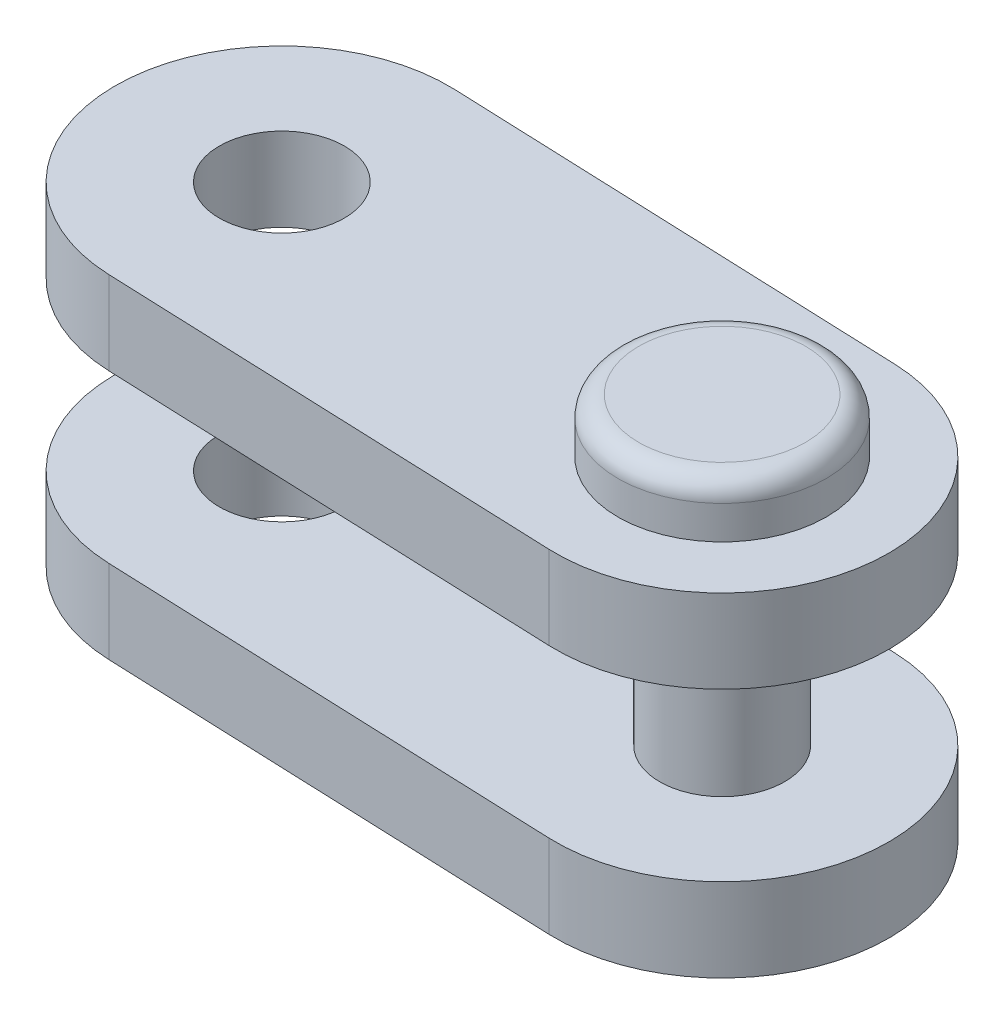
ISO-10303-21;
HEADER;
FILE_DESCRIPTION(('STEP AP214'),'2;1');
FILE_NAME('part.step','',(''),(''),'','','');
FILE_SCHEMA(('AUTOMOTIVE_DESIGN { 1 0 10303 214 1 1 1 1 }'));
ENDSEC;
DATA;
#1=APPLICATION_CONTEXT('core data for automotive mechanical design processes');
#2=APPLICATION_PROTOCOL_DEFINITION('international standard','automotive_design',2000,#1);
#3=PRODUCT_CONTEXT('',#1,'mechanical');
#4=PRODUCT('Part','Part','',(#3));
#5=PRODUCT_RELATED_PRODUCT_CATEGORY('part','',(#4));
#6=PRODUCT_DEFINITION_FORMATION('','',#4);
#7=PRODUCT_DEFINITION_CONTEXT('part definition',#1,'design');
#8=PRODUCT_DEFINITION('design','',#6,#7);
#9=PRODUCT_DEFINITION_SHAPE('','',#8);
#10=(LENGTH_UNIT() NAMED_UNIT(*) SI_UNIT(.MILLI.,.METRE.));
#11=(NAMED_UNIT(*) PLANE_ANGLE_UNIT() SI_UNIT($,.RADIAN.));
#12=(NAMED_UNIT(*) SI_UNIT($,.STERADIAN.) SOLID_ANGLE_UNIT());
#13=UNCERTAINTY_MEASURE_WITH_UNIT(LENGTH_MEASURE(1.E-05),#10,'distance_accuracy_value','');
#14=(GEOMETRIC_REPRESENTATION_CONTEXT(3) GLOBAL_UNCERTAINTY_ASSIGNED_CONTEXT((#13)) GLOBAL_UNIT_ASSIGNED_CONTEXT((#10,
#11,#12)) REPRESENTATION_CONTEXT('',''));
#15=CARTESIAN_POINT('',(0.,0.,0.));
#16=DIRECTION('',(0.,0.,1.));
#17=DIRECTION('',(1.,0.,0.));
#18=AXIS2_PLACEMENT_3D('',#15,#16,#17);
#19=CARTESIAN_POINT('',(-10.991642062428,4.,-0.428724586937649));
#20=DIRECTION('',(0.,-1.,0.));
#21=DIRECTION('',(0.999207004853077,0.,0.0398165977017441));
#22=AXIS2_PLACEMENT_3D('',#19,#20,#21);
#23=PLANE('',#22);
#24=DIRECTION('',(0.999240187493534,0.,0.038974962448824));
#25=VECTOR('',#24,1.);
#26=CARTESIAN_POINT('',(-11.1475419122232,4.00000000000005,3.56823616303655));
#27=LINE('',#26,#25);
#28=CARTESIAN_POINT('',(-11.1475419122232,4.,3.56823616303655));
#29=VERTEX_POINT('',#28);
#30=CARTESIAN_POINT('',(-0.155899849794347,4.00000000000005,3.9969607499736));
#31=VERTEX_POINT('',#30);
#32=EDGE_CURVE('E168',#29,#31,#27,.T.);
#33=ORIENTED_EDGE('',*,*,#32,.T.);
#34=CARTESIAN_POINT('',(9.99200722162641E-13,4.00000000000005,-6.00214322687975E-13));
#35=DIRECTION('',(0.,1.,0.));
#36=DIRECTION('',(-0.999207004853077,0.,-0.0398165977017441));
#37=AXIS2_PLACEMENT_3D('',#34,#35,#36);
#38=CIRCLE('',#37,4.00000000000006);
#39=CARTESIAN_POINT('',(0.155899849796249,4.00000000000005,-3.99696074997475));
#40=VERTEX_POINT('',#39);
#41=EDGE_CURVE('E171',#40,#31,#38,.F.);
#42=ORIENTED_EDGE('',*,*,#41,.F.);
#43=DIRECTION('',(-0.999240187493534,0.,-0.038974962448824));
#44=VECTOR('',#43,1.);
#45=CARTESIAN_POINT('',(-10.8357422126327,4.,-4.4256853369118));
#46=LINE('',#45,#44);
#47=CARTESIAN_POINT('',(-10.8357422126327,4.,-4.4256853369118));
#48=VERTEX_POINT('',#47);
#49=EDGE_CURVE('E175',#40,#48,#46,.T.);
#50=ORIENTED_EDGE('',*,*,#49,.T.);
#51=CARTESIAN_POINT('',(-10.991642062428,4.,-0.428724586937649));
#52=DIRECTION('',(0.,1.,0.));
#53=DIRECTION('',(-0.999207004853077,0.,-0.0398165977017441));
#54=AXIS2_PLACEMENT_3D('',#51,#52,#53);
#55=CIRCLE('',#54,4.);
#56=EDGE_CURVE('E152',#29,#48,#55,.F.);
#57=ORIENTED_EDGE('',*,*,#56,.F.);
#58=EDGE_LOOP('',(#33,#42,#50,#57));
#59=FACE_BOUND('',#58,.T.);
#60=CARTESIAN_POINT('',(-10.991642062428,4.,-0.428724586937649));
#61=DIRECTION('',(0.,-1.,0.));
#62=DIRECTION('',(0.999207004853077,0.,0.0398165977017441));
#63=AXIS2_PLACEMENT_3D('',#60,#61,#62);
#64=CIRCLE('',#63,1.500000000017);
#65=CARTESIAN_POINT('',(-9.4928315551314,4.,-0.368999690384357));
#66=VERTEX_POINT('',#65);
#67=EDGE_CURVE('E149',#66,#66,#64,.F.);
#68=ORIENTED_EDGE('',*,*,#67,.F.);
#69=EDGE_LOOP('',(#68));
#70=FACE_BOUND('',#69,.T.);
#71=CARTESIAN_POINT('',(0.,4.,0.));
#72=DIRECTION('',(0.,-1.,0.));
#73=DIRECTION('',(1.,0.,0.));
#74=AXIS2_PLACEMENT_3D('',#71,#72,#73);
#75=CIRCLE('',#74,2.5);
#76=CARTESIAN_POINT('',(2.5,4.,0.));
#77=VERTEX_POINT('',#76);
#78=EDGE_CURVE('E26',#77,#77,#75,.T.);
#79=ORIENTED_EDGE('',*,*,#78,.T.);
#80=EDGE_LOOP('',(#79));
#81=FACE_BOUND('',#80,.T.);
#82=ADVANCED_FACE('F17',(#59,#70,#81),#23,.F.);
#83=CARTESIAN_POINT('',(0.,-4.00000000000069,0.));
#84=DIRECTION('',(0.,1.,0.));
#85=DIRECTION('',(-0.34082035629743,0.,0.940128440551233));
#86=AXIS2_PLACEMENT_3D('',#83,#84,#85);
#87=CYLINDRICAL_SURFACE('',#86,1.5);
#88=CARTESIAN_POINT('',(9.5062846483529E-13,-1.99999999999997,-6.00214322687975E-13));
#89=DIRECTION('',(0.,-1.,0.));
#90=DIRECTION('',(0.999207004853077,0.,0.0398165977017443));
#91=AXIS2_PLACEMENT_3D('',#88,#89,#90);
#92=CIRCLE('',#91,1.50000000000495);
#93=CARTESIAN_POINT('',(1.49881050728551,-1.99999999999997,0.0597248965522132));
#94=VERTEX_POINT('',#93);
#95=EDGE_CURVE('E133',#94,#94,#92,.F.);
#96=ORIENTED_EDGE('',*,*,#95,.T.);
#97=EDGE_LOOP('',(#96));
#98=FACE_BOUND('',#97,.T.);
#99=CARTESIAN_POINT('',(9.99200722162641E-13,2.00000000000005,-6.00214322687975E-13));
#100=DIRECTION('',(0.,-1.,0.));
#101=DIRECTION('',(0.999207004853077,0.,0.0398165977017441));
#102=AXIS2_PLACEMENT_3D('',#99,#100,#101);
#103=CIRCLE('',#102,1.50000000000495);
#104=CARTESIAN_POINT('',(1.49881050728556,2.00000000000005,0.0597248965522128));
#105=VERTEX_POINT('',#104);
#106=EDGE_CURVE('E129',#105,#105,#103,.T.);
#107=ORIENTED_EDGE('',*,*,#106,.T.);
#108=EDGE_LOOP('',(#107));
#109=FACE_BOUND('',#108,.T.);
#110=ADVANCED_FACE('F221',(#98,#109),#87,.T.);
#111=CARTESIAN_POINT('',(-10.991642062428,2.00000000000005,-0.428724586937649));
#112=DIRECTION('',(0.,-1.,0.));
#113=DIRECTION('',(0.999207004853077,0.,0.0398165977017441));
#114=AXIS2_PLACEMENT_3D('',#111,#112,#113);
#115=CYLINDRICAL_SURFACE('',#114,1.49999999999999);
#116=CARTESIAN_POINT('',(-10.991642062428,2.00000000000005,-0.428724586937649));
#117=DIRECTION('',(0.,-1.,0.));
#118=DIRECTION('',(0.999207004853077,0.,0.0398165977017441));
#119=AXIS2_PLACEMENT_3D('',#116,#117,#118);
#120=CIRCLE('',#119,1.500000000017);
#121=CARTESIAN_POINT('',(-9.4928315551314,2.00000000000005,-0.368999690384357));
#122=VERTEX_POINT('',#121);
#123=EDGE_CURVE('E146',#122,#122,#120,.T.);
#124=ORIENTED_EDGE('',*,*,#123,.T.);
#125=EDGE_LOOP('',(#124));
#126=FACE_BOUND('',#125,.T.);
#127=ORIENTED_EDGE('',*,*,#67,.T.);
#128=EDGE_LOOP('',(#127));
#129=FACE_BOUND('',#128,.T.);
#130=ADVANCED_FACE('F219',(#126,#129),#115,.F.);
#131=CARTESIAN_POINT('',(-10.8357422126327,2.00000000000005,-4.4256853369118));
#132=DIRECTION('',(-0.038974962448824,0.,0.999240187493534));
#133=DIRECTION('',(-0.999240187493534,0.,-0.038974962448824));
#134=AXIS2_PLACEMENT_3D('',#131,#132,#133);
#135=PLANE('',#134);
#136=DIRECTION('',(0.,1.,0.));
#137=VECTOR('',#136,1.);
#138=CARTESIAN_POINT('',(0.155899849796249,2.00000000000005,-3.9969607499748));
#139=LINE('',#138,#137);
#140=CARTESIAN_POINT('',(0.155899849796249,2.00000000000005,-3.99696074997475));
#141=VERTEX_POINT('',#140);
#142=EDGE_CURVE('E165',#141,#40,#139,.T.);
#143=ORIENTED_EDGE('',*,*,#142,.F.);
#144=DIRECTION('',(0.999240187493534,0.,0.038974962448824));
#145=VECTOR('',#144,1.);
#146=CARTESIAN_POINT('',(-10.8357422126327,2.00000000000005,-4.4256853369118));
#147=LINE('',#146,#145);
#148=CARTESIAN_POINT('',(-10.8357422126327,2.00000000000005,-4.4256853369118));
#149=VERTEX_POINT('',#148);
#150=EDGE_CURVE('E158',#149,#141,#147,.T.);
#151=ORIENTED_EDGE('',*,*,#150,.F.);
#152=DIRECTION('',(0.,-1.,0.));
#153=VECTOR('',#152,1.);
#154=CARTESIAN_POINT('',(-10.8357422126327,2.00000000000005,-4.4256853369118));
#155=LINE('',#154,#153);
#156=EDGE_CURVE('E172',#48,#149,#155,.T.);
#157=ORIENTED_EDGE('',*,*,#156,.F.);
#158=ORIENTED_EDGE('',*,*,#49,.F.);
#159=EDGE_LOOP('',(#143,#151,#157,#158));
#160=FACE_BOUND('',#159,.T.);
#161=ADVANCED_FACE('F236',(#160),#135,.F.);
#162=CARTESIAN_POINT('',(-10.991642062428,2.00000000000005,-0.428724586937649));
#163=DIRECTION('',(0.,1.,0.));
#164=DIRECTION('',(-0.999207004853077,0.,-0.0398165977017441));
#165=AXIS2_PLACEMENT_3D('',#162,#163,#164);
#166=CYLINDRICAL_SURFACE('',#165,4.);
#167=ORIENTED_EDGE('',*,*,#56,.T.);
#168=ORIENTED_EDGE('',*,*,#156,.T.);
#169=CARTESIAN_POINT('',(-10.991642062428,2.00000000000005,-0.428724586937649));
#170=DIRECTION('',(0.,1.,0.));
#171=DIRECTION('',(-0.999207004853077,0.,-0.0398165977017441));
#172=AXIS2_PLACEMENT_3D('',#169,#170,#171);
#173=CIRCLE('',#172,4.);
#174=CARTESIAN_POINT('',(-11.1475419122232,2.00000000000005,3.56823616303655));
#175=VERTEX_POINT('',#174);
#176=EDGE_CURVE('E161',#175,#149,#173,.F.);
#177=ORIENTED_EDGE('',*,*,#176,.F.);
#178=DIRECTION('',(0.,-1.,0.));
#179=VECTOR('',#178,1.);
#180=CARTESIAN_POINT('',(-11.1475419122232,2.00000000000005,3.56823616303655));
#181=LINE('',#180,#179);
#182=EDGE_CURVE('E164',#175,#29,#181,.F.);
#183=ORIENTED_EDGE('',*,*,#182,.T.);
#184=EDGE_LOOP('',(#167,#168,#177,#183));
#185=FACE_BOUND('',#184,.T.);
#186=ADVANCED_FACE('F233',(#185),#166,.T.);
#187=CARTESIAN_POINT('',(-11.1475419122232,2.00000000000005,3.56823616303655));
#188=DIRECTION('',(0.038974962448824,0.,-0.999240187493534));
#189=DIRECTION('',(0.999240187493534,0.,0.038974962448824));
#190=AXIS2_PLACEMENT_3D('',#187,#188,#189);
#191=PLANE('',#190);
#192=ORIENTED_EDGE('',*,*,#182,.F.);
#193=DIRECTION('',(-0.999240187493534,0.,-0.0389749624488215));
#194=VECTOR('',#193,1.);
#195=CARTESIAN_POINT('',(-0.155899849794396,2.00000000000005,3.99696074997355));
#196=LINE('',#195,#194);
#197=CARTESIAN_POINT('',(-0.155899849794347,2.00000000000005,3.9969607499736));
#198=VERTEX_POINT('',#197);
#199=EDGE_CURVE('E153',#198,#175,#196,.T.);
#200=ORIENTED_EDGE('',*,*,#199,.F.);
#201=DIRECTION('',(0.,-1.,0.));
#202=VECTOR('',#201,1.);
#203=CARTESIAN_POINT('',(-0.155899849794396,2.00000000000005,3.9969607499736));
#204=LINE('',#203,#202);
#205=EDGE_CURVE('E162',#31,#198,#204,.T.);
#206=ORIENTED_EDGE('',*,*,#205,.F.);
#207=ORIENTED_EDGE('',*,*,#32,.F.);
#208=EDGE_LOOP('',(#192,#200,#206,#207));
#209=FACE_BOUND('',#208,.T.);
#210=ADVANCED_FACE('F246',(#209),#191,.F.);
#211=CARTESIAN_POINT('',(9.99200722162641E-13,2.00000000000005,-6.00214322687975E-13));
#212=DIRECTION('',(0.,1.,0.));
#213=DIRECTION('',(-0.999207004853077,0.,-0.0398165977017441));
#214=AXIS2_PLACEMENT_3D('',#211,#212,#213);
#215=CYLINDRICAL_SURFACE('',#214,4.00000000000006);
#216=CARTESIAN_POINT('',(9.99200722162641E-13,2.00000000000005,-6.00214322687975E-13));
#217=DIRECTION('',(0.,1.,0.));
#218=DIRECTION('',(-0.999207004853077,0.,-0.0398165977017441));
#219=AXIS2_PLACEMENT_3D('',#216,#217,#218);
#220=CIRCLE('',#219,4.00000000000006);
#221=EDGE_CURVE('E157',#141,#198,#220,.F.);
#222=ORIENTED_EDGE('',*,*,#221,.F.);
#223=ORIENTED_EDGE('',*,*,#142,.T.);
#224=ORIENTED_EDGE('',*,*,#41,.T.);
#225=ORIENTED_EDGE('',*,*,#205,.T.);
#226=EDGE_LOOP('',(#222,#223,#224,#225));
#227=FACE_BOUND('',#226,.T.);
#228=ADVANCED_FACE('F243',(#227),#215,.T.);
#229=CARTESIAN_POINT('',(-10.991642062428,2.00000000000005,-0.428724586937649));
#230=DIRECTION('',(0.,-1.,0.));
#231=DIRECTION('',(0.999207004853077,0.,0.0398165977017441));
#232=AXIS2_PLACEMENT_3D('',#229,#230,#231);
#233=PLANE('',#232);
#234=ORIENTED_EDGE('',*,*,#221,.T.);
#235=ORIENTED_EDGE('',*,*,#199,.T.);
#236=ORIENTED_EDGE('',*,*,#176,.T.);
#237=ORIENTED_EDGE('',*,*,#150,.T.);
#238=EDGE_LOOP('',(#234,#235,#236,#237));
#239=FACE_BOUND('',#238,.T.);
#240=ORIENTED_EDGE('',*,*,#123,.F.);
#241=EDGE_LOOP('',(#240));
#242=FACE_BOUND('',#241,.T.);
#243=ORIENTED_EDGE('',*,*,#106,.F.);
#244=EDGE_LOOP('',(#243));
#245=FACE_BOUND('',#244,.T.);
#246=ADVANCED_FACE('F254',(#239,#242,#245),#233,.T.);
#247=CARTESIAN_POINT('',(-10.991642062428,-4.,-0.428724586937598));
#248=DIRECTION('',(0.,-1.,0.));
#249=DIRECTION('',(0.999207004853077,0.,0.0398165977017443));
#250=AXIS2_PLACEMENT_3D('',#247,#248,#249);
#251=CYLINDRICAL_SURFACE('',#250,1.49999999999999);
#252=CARTESIAN_POINT('',(-10.991642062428,-4.,-0.428724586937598));
#253=DIRECTION('',(0.,-1.,0.));
#254=DIRECTION('',(0.999207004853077,0.,0.0398165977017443));
#255=AXIS2_PLACEMENT_3D('',#252,#253,#254);
#256=CIRCLE('',#255,1.500000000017);
#257=CARTESIAN_POINT('',(-9.4928315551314,-4.,-0.368999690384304));
#258=VERTEX_POINT('',#257);
#259=EDGE_CURVE('E185',#258,#258,#256,.T.);
#260=ORIENTED_EDGE('',*,*,#259,.T.);
#261=EDGE_LOOP('',(#260));
#262=FACE_BOUND('',#261,.T.);
#263=CARTESIAN_POINT('',(-10.991642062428,-2.,-0.428724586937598));
#264=DIRECTION('',(0.,-1.,0.));
#265=DIRECTION('',(0.999207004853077,0.,0.0398165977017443));
#266=AXIS2_PLACEMENT_3D('',#263,#264,#265);
#267=CIRCLE('',#266,1.500000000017);
#268=CARTESIAN_POINT('',(-9.4928315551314,-2.,-0.368999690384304));
#269=VERTEX_POINT('',#268);
#270=EDGE_CURVE('E102',#269,#269,#267,.F.);
#271=ORIENTED_EDGE('',*,*,#270,.T.);
#272=EDGE_LOOP('',(#271));
#273=FACE_BOUND('',#272,.T.);
#274=ADVANCED_FACE('F213',(#262,#273),#251,.F.);
#275=CARTESIAN_POINT('',(-10.991642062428,-4.,-0.428724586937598));
#276=DIRECTION('',(0.,1.,0.));
#277=DIRECTION('',(-0.999207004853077,0.,-0.0398165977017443));
#278=AXIS2_PLACEMENT_3D('',#275,#276,#277);
#279=CYLINDRICAL_SURFACE('',#278,4.);
#280=CARTESIAN_POINT('',(-10.991642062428,-2.,-0.428724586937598));
#281=DIRECTION('',(0.,1.,0.));
#282=DIRECTION('',(-0.999207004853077,0.,-0.0398165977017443));
#283=AXIS2_PLACEMENT_3D('',#280,#281,#282);
#284=CIRCLE('',#283,4.);
#285=CARTESIAN_POINT('',(-11.1475419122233,-2.,3.56823616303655));
#286=VERTEX_POINT('',#285);
#287=CARTESIAN_POINT('',(-10.8357422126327,-2.,-4.4256853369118));
#288=VERTEX_POINT('',#287);
#289=EDGE_CURVE('E91',#286,#288,#284,.F.);
#290=ORIENTED_EDGE('',*,*,#289,.T.);
#291=DIRECTION('',(0.,-1.,0.));
#292=VECTOR('',#291,1.);
#293=CARTESIAN_POINT('',(-10.8357422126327,-4.,-4.4256853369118));
#294=LINE('',#293,#292);
#295=CARTESIAN_POINT('',(-10.8357422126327,-4.,-4.4256853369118));
#296=VERTEX_POINT('',#295);
#297=EDGE_CURVE('E95',#288,#296,#294,.T.);
#298=ORIENTED_EDGE('',*,*,#297,.T.);
#299=CARTESIAN_POINT('',(-10.991642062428,-4.,-0.428724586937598));
#300=DIRECTION('',(0.,1.,0.));
#301=DIRECTION('',(-0.999207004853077,0.,-0.0398165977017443));
#302=AXIS2_PLACEMENT_3D('',#299,#300,#301);
#303=CIRCLE('',#302,4.);
#304=CARTESIAN_POINT('',(-11.1475419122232,-4.,3.56823616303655));
#305=VERTEX_POINT('',#304);
#306=EDGE_CURVE('E121',#305,#296,#303,.F.);
#307=ORIENTED_EDGE('',*,*,#306,.F.);
#308=DIRECTION('',(0.,-1.,0.));
#309=VECTOR('',#308,1.);
#310=CARTESIAN_POINT('',(-11.1475419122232,-4.,3.56823616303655));
#311=LINE('',#310,#309);
#312=EDGE_CURVE('E98',#305,#286,#311,.F.);
#313=ORIENTED_EDGE('',*,*,#312,.T.);
#314=EDGE_LOOP('',(#290,#298,#307,#313));
#315=FACE_BOUND('',#314,.T.);
#316=ADVANCED_FACE('F93',(#315),#279,.T.);
#317=CARTESIAN_POINT('',(-10.8357422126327,-4.,-4.4256853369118));
#318=DIRECTION('',(-0.0389749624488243,0.,0.999240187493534));
#319=DIRECTION('',(-0.999240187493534,0.,-0.0389749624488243));
#320=AXIS2_PLACEMENT_3D('',#317,#318,#319);
#321=PLANE('',#320);
#322=DIRECTION('',(0.,1.,0.));
#323=VECTOR('',#322,1.);
#324=CARTESIAN_POINT('',(0.155899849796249,-4.,-3.9969607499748));
#325=LINE('',#324,#323);
#326=CARTESIAN_POINT('',(0.155899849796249,-4.,-3.99696074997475));
#327=VERTEX_POINT('',#326);
#328=CARTESIAN_POINT('',(0.155899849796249,-2.,-3.99696074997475));
#329=VERTEX_POINT('',#328);
#330=EDGE_CURVE('E118',#327,#329,#325,.T.);
#331=ORIENTED_EDGE('',*,*,#330,.F.);
#332=DIRECTION('',(0.999240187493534,0.,0.0389749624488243));
#333=VECTOR('',#332,1.);
#334=CARTESIAN_POINT('',(-10.8357422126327,-4.,-4.4256853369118));
#335=LINE('',#334,#333);
#336=EDGE_CURVE('E114',#296,#327,#335,.T.);
#337=ORIENTED_EDGE('',*,*,#336,.F.);
#338=ORIENTED_EDGE('',*,*,#297,.F.);
#339=DIRECTION('',(-0.999240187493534,0.,-0.0389749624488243));
#340=VECTOR('',#339,1.);
#341=CARTESIAN_POINT('',(-10.8357422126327,-2.,-4.4256853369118));
#342=LINE('',#341,#340);
#343=EDGE_CURVE('E105',#329,#288,#342,.T.);
#344=ORIENTED_EDGE('',*,*,#343,.F.);
#345=EDGE_LOOP('',(#331,#337,#338,#344));
#346=FACE_BOUND('',#345,.T.);
#347=ADVANCED_FACE('F112',(#346),#321,.F.);
#348=CARTESIAN_POINT('',(9.5062846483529E-13,-4.,-6.00214322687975E-13));
#349=DIRECTION('',(0.,1.,0.));
#350=DIRECTION('',(-0.999207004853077,0.,-0.0398165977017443));
#351=AXIS2_PLACEMENT_3D('',#348,#349,#350);
#352=CYLINDRICAL_SURFACE('',#351,4.00000000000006);
#353=CARTESIAN_POINT('',(9.5062846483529E-13,-4.,-6.00214322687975E-13));
#354=DIRECTION('',(0.,1.,0.));
#355=DIRECTION('',(-0.999207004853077,0.,-0.0398165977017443));
#356=AXIS2_PLACEMENT_3D('',#353,#354,#355);
#357=CIRCLE('',#356,4.00000000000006);
#358=CARTESIAN_POINT('',(-0.155899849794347,-4.,3.9969607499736));
#359=VERTEX_POINT('',#358);
#360=EDGE_CURVE('E123',#327,#359,#357,.F.);
#361=ORIENTED_EDGE('',*,*,#360,.F.);
#362=ORIENTED_EDGE('',*,*,#330,.T.);
#363=CARTESIAN_POINT('',(9.5062846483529E-13,-1.99999999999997,-6.00214322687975E-13));
#364=DIRECTION('',(0.,1.,0.));
#365=DIRECTION('',(-0.999207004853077,0.,-0.0398165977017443));
#366=AXIS2_PLACEMENT_3D('',#363,#364,#365);
#367=CIRCLE('',#366,4.00000000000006);
#368=CARTESIAN_POINT('',(-0.155899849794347,-1.99999999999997,3.9969607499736));
#369=VERTEX_POINT('',#368);
#370=EDGE_CURVE('E108',#329,#369,#367,.F.);
#371=ORIENTED_EDGE('',*,*,#370,.T.);
#372=DIRECTION('',(0.,-1.,0.));
#373=VECTOR('',#372,1.);
#374=CARTESIAN_POINT('',(-0.155899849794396,-4.,3.9969607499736));
#375=LINE('',#374,#373);
#376=EDGE_CURVE('E193',#369,#359,#375,.T.);
#377=ORIENTED_EDGE('',*,*,#376,.T.);
#378=EDGE_LOOP('',(#361,#362,#371,#377));
#379=FACE_BOUND('',#378,.T.);
#380=ADVANCED_FACE('F198',(#379),#352,.T.);
#381=CARTESIAN_POINT('',(-11.1475419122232,-4.,3.56823616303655));
#382=DIRECTION('',(0.0389749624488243,0.,-0.999240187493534));
#383=DIRECTION('',(0.999240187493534,0.,0.0389749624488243));
#384=AXIS2_PLACEMENT_3D('',#381,#382,#383);
#385=PLANE('',#384);
#386=ORIENTED_EDGE('',*,*,#312,.F.);
#387=DIRECTION('',(-0.999240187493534,0.,-0.0389749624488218));
#388=VECTOR('',#387,1.);
#389=CARTESIAN_POINT('',(-0.155899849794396,-4.,3.9969607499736));
#390=LINE('',#389,#388);
#391=EDGE_CURVE('E126',#359,#305,#390,.T.);
#392=ORIENTED_EDGE('',*,*,#391,.F.);
#393=ORIENTED_EDGE('',*,*,#376,.F.);
#394=DIRECTION('',(0.999240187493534,0.,0.0389749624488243));
#395=VECTOR('',#394,1.);
#396=CARTESIAN_POINT('',(-11.1475419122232,-2.,3.56823616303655));
#397=LINE('',#396,#395);
#398=EDGE_CURVE('E120',#286,#369,#397,.T.);
#399=ORIENTED_EDGE('',*,*,#398,.F.);
#400=EDGE_LOOP('',(#386,#392,#393,#399));
#401=FACE_BOUND('',#400,.T.);
#402=ADVANCED_FACE('F203',(#401),#385,.F.);
#403=CARTESIAN_POINT('',(-10.991642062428,-2.,-0.428724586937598));
#404=DIRECTION('',(0.,-1.,0.));
#405=DIRECTION('',(0.999207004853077,0.,0.0398165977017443));
#406=AXIS2_PLACEMENT_3D('',#403,#404,#405);
#407=PLANE('',#406);
#408=ORIENTED_EDGE('',*,*,#398,.T.);
#409=ORIENTED_EDGE('',*,*,#370,.F.);
#410=ORIENTED_EDGE('',*,*,#343,.T.);
#411=ORIENTED_EDGE('',*,*,#289,.F.);
#412=EDGE_LOOP('',(#408,#409,#410,#411));
#413=FACE_BOUND('',#412,.T.);
#414=ORIENTED_EDGE('',*,*,#270,.F.);
#415=EDGE_LOOP('',(#414));
#416=FACE_BOUND('',#415,.T.);
#417=ORIENTED_EDGE('',*,*,#95,.F.);
#418=EDGE_LOOP('',(#417));
#419=FACE_BOUND('',#418,.T.);
#420=ADVANCED_FACE('F106',(#413,#416,#419),#407,.F.);
#421=CARTESIAN_POINT('',(-10.991642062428,-4.,-0.428724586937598));
#422=DIRECTION('',(0.,-1.,0.));
#423=DIRECTION('',(0.999207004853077,0.,0.0398165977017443));
#424=AXIS2_PLACEMENT_3D('',#421,#422,#423);
#425=PLANE('',#424);
#426=CARTESIAN_POINT('',(0.,-4.,0.));
#427=DIRECTION('',(0.,-1.,0.));
#428=DIRECTION('',(1.,0.,0.));
#429=AXIS2_PLACEMENT_3D('',#426,#427,#428);
#430=CIRCLE('',#429,2.5);
#431=CARTESIAN_POINT('',(2.5,-4.,0.));
#432=VERTEX_POINT('',#431);
#433=EDGE_CURVE('E11',#432,#432,#430,.T.);
#434=ORIENTED_EDGE('',*,*,#433,.F.);
#435=EDGE_LOOP('',(#434));
#436=FACE_BOUND('',#435,.T.);
#437=ORIENTED_EDGE('',*,*,#360,.T.);
#438=ORIENTED_EDGE('',*,*,#391,.T.);
#439=ORIENTED_EDGE('',*,*,#306,.T.);
#440=ORIENTED_EDGE('',*,*,#336,.T.);
#441=EDGE_LOOP('',(#437,#438,#439,#440));
#442=FACE_BOUND('',#441,.T.);
#443=ORIENTED_EDGE('',*,*,#259,.F.);
#444=EDGE_LOOP('',(#443));
#445=FACE_BOUND('',#444,.T.);
#446=ADVANCED_FACE('F200',(#436,#442,#445),#425,.T.);
#447=CARTESIAN_POINT('',(0.,5.29999999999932,0.));
#448=DIRECTION('',(0.,-1.,0.));
#449=DIRECTION('',(0.34082035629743,0.,-0.940128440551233));
#450=AXIS2_PLACEMENT_3D('',#447,#448,#449);
#451=PLANE('',#450);
#452=CARTESIAN_POINT('',(0.,5.29999999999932,0.));
#453=DIRECTION('',(0.,-1.,0.));
#454=DIRECTION('',(0.340820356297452,0.,-0.940128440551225));
#455=AXIS2_PLACEMENT_3D('',#452,#453,#454);
#456=CIRCLE('',#455,2.);
#457=CARTESIAN_POINT('',(0.681640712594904,5.29999999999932,-1.88025688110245));
#458=VERTEX_POINT('',#457);
#459=CARTESIAN_POINT('',(-0.681640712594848,5.29999999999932,1.88025688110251));
#460=VERTEX_POINT('',#459);
#461=EDGE_CURVE('E33',#458,#460,#456,.T.);
#462=ORIENTED_EDGE('',*,*,#461,.F.);
#463=CARTESIAN_POINT('',(0.,5.29999999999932,0.));
#464=DIRECTION('',(0.,-1.,0.));
#465=DIRECTION('',(-0.340820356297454,0.,0.940128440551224));
#466=AXIS2_PLACEMENT_3D('',#463,#464,#465);
#467=CIRCLE('',#466,2.);
#468=EDGE_CURVE('E324',#460,#458,#467,.T.);
#469=ORIENTED_EDGE('',*,*,#468,.F.);
#470=EDGE_LOOP('',(#462,#469));
#471=FACE_BOUND('',#470,.T.);
#472=ADVANCED_FACE('F217',(#471),#451,.F.);
#473=CARTESIAN_POINT('',(0.,4.79999999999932,0.));
#474=DIRECTION('',(0.,-1.,0.));
#475=DIRECTION('',(0.340820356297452,0.,-0.940128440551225));
#476=AXIS2_PLACEMENT_3D('',#473,#474,#475);
#477=TOROIDAL_SURFACE('',#476,2.,0.5);
#478=ORIENTED_EDGE('',*,*,#461,.T.);
#479=ORIENTED_EDGE('',*,*,#468,.T.);
#480=EDGE_LOOP('',(#478,#479));
#481=FACE_BOUND('',#480,.T.);
#482=CARTESIAN_POINT('',(0.,4.79999999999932,0.));
#483=DIRECTION('',(0.,1.,0.));
#484=DIRECTION('',(-0.34082035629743,0.,0.940128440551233));
#485=AXIS2_PLACEMENT_3D('',#482,#483,#484);
#486=CIRCLE('',#485,2.5);
#487=CARTESIAN_POINT('',(-0.852050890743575,4.79999999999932,2.35032110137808));
#488=VERTEX_POINT('',#487);
#489=EDGE_CURVE('E138',#488,#488,#486,.F.);
#490=ORIENTED_EDGE('',*,*,#489,.F.);
#491=EDGE_LOOP('',(#490));
#492=FACE_BOUND('',#491,.T.);
#493=ADVANCED_FACE('F315',(#481,#492),#477,.T.);
#494=CARTESIAN_POINT('',(0.,3.99999999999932,0.));
#495=DIRECTION('',(0.,1.,0.));
#496=DIRECTION('',(-0.34082035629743,0.,0.940128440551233));
#497=AXIS2_PLACEMENT_3D('',#494,#495,#496);
#498=CYLINDRICAL_SURFACE('',#497,2.5);
#499=ORIENTED_EDGE('',*,*,#489,.T.);
#500=EDGE_LOOP('',(#499));
#501=FACE_BOUND('',#500,.T.);
#502=ORIENTED_EDGE('',*,*,#78,.F.);
#503=EDGE_LOOP('',(#502));
#504=FACE_BOUND('',#503,.T.);
#505=ADVANCED_FACE('F19',(#501,#504),#498,.T.);
#506=CARTESIAN_POINT('',(0.,-5.30000000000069,0.));
#507=DIRECTION('',(0.,1.,0.));
#508=DIRECTION('',(-0.34082035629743,0.,0.940128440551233));
#509=AXIS2_PLACEMENT_3D('',#506,#507,#508);
#510=PLANE('',#509);
#511=CARTESIAN_POINT('',(0.,-5.30000000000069,0.));
#512=DIRECTION('',(0.,1.,0.));
#513=DIRECTION('',(-0.340820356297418,0.,0.940128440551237));
#514=AXIS2_PLACEMENT_3D('',#511,#512,#513);
#515=CIRCLE('',#514,2.00000000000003);
#516=CARTESIAN_POINT('',(-0.681640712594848,-5.30000000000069,1.88025688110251));
#517=VERTEX_POINT('',#516);
#518=CARTESIAN_POINT('',(0.681640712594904,-5.30000000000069,-1.88025688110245));
#519=VERTEX_POINT('',#518);
#520=EDGE_CURVE('E156',#517,#519,#515,.T.);
#521=ORIENTED_EDGE('',*,*,#520,.F.);
#522=CARTESIAN_POINT('',(0.,-5.30000000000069,0.));
#523=DIRECTION('',(0.,1.,0.));
#524=DIRECTION('',(0.340820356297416,0.,-0.940128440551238));
#525=AXIS2_PLACEMENT_3D('',#522,#523,#524);
#526=CIRCLE('',#525,2.00000000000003);
#527=EDGE_CURVE('E300',#519,#517,#526,.T.);
#528=ORIENTED_EDGE('',*,*,#527,.F.);
#529=EDGE_LOOP('',(#521,#528));
#530=FACE_BOUND('',#529,.T.);
#531=ADVANCED_FACE('F274',(#530),#510,.F.);
#532=CARTESIAN_POINT('',(0.,-4.80000000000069,0.));
#533=DIRECTION('',(0.,1.,0.));
#534=DIRECTION('',(-0.340820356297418,0.,0.940128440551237));
#535=AXIS2_PLACEMENT_3D('',#532,#533,#534);
#536=TOROIDAL_SURFACE('',#535,2.00000000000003,0.5);
#537=ORIENTED_EDGE('',*,*,#520,.T.);
#538=ORIENTED_EDGE('',*,*,#527,.T.);
#539=EDGE_LOOP('',(#537,#538));
#540=FACE_BOUND('',#539,.T.);
#541=CARTESIAN_POINT('',(0.,-4.80000000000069,0.));
#542=DIRECTION('',(0.,-1.,0.));
#543=DIRECTION('',(0.34082035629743,0.,-0.940128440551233));
#544=AXIS2_PLACEMENT_3D('',#541,#542,#543);
#545=CIRCLE('',#544,2.5);
#546=CARTESIAN_POINT('',(0.852050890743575,-4.80000000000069,-2.35032110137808));
#547=VERTEX_POINT('',#546);
#548=EDGE_CURVE('E322',#547,#547,#545,.F.);
#549=ORIENTED_EDGE('',*,*,#548,.F.);
#550=EDGE_LOOP('',(#549));
#551=FACE_BOUND('',#550,.T.);
#552=ADVANCED_FACE('F278',(#540,#551),#536,.T.);
#553=CARTESIAN_POINT('',(0.,-4.00000000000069,0.));
#554=DIRECTION('',(0.,-1.,0.));
#555=DIRECTION('',(0.34082035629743,0.,-0.940128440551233));
#556=AXIS2_PLACEMENT_3D('',#553,#554,#555);
#557=CYLINDRICAL_SURFACE('',#556,2.5);
#558=ORIENTED_EDGE('',*,*,#548,.T.);
#559=EDGE_LOOP('',(#558));
#560=FACE_BOUND('',#559,.T.);
#561=ORIENTED_EDGE('',*,*,#433,.T.);
#562=EDGE_LOOP('',(#561));
#563=FACE_BOUND('',#562,.T.);
#564=ADVANCED_FACE('F314',(#560,#563),#557,.T.);
#565=CLOSED_SHELL('',(#82,#110,#130,#161,#186,#210,#228,#246,#274,#316,#347,#380,#402,#420,#446,
#472,#493,#505,#531,#552,#564));
#566=MANIFOLD_SOLID_BREP('B1',#565);
#567=ADVANCED_BREP_SHAPE_REPRESENTATION('',(#18,#566),#14);
#568=SHAPE_DEFINITION_REPRESENTATION(#9,#567);
ENDSEC;
END-ISO-10303-21;
